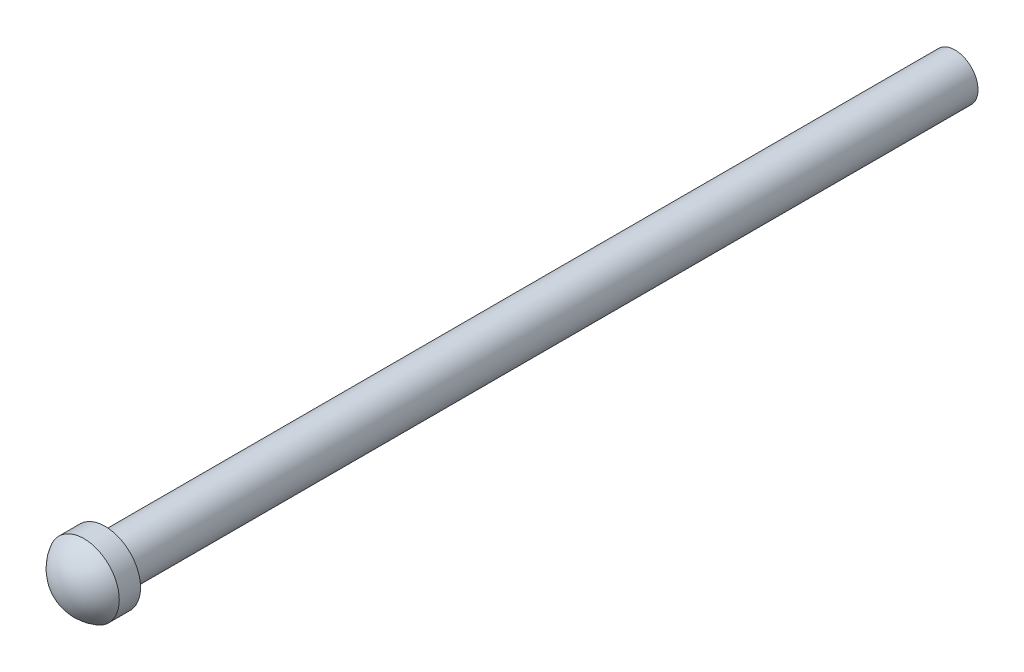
from build123d import *

# Parameters (mm, degrees)
CROQUIS1_R              = 3.25
CROQUIS3_R              = 5
SALIENTE_EXTRUIR1_DEPTH = 3
C_PULA1_FACE_RADIUS     = 5
C_PULA1_HEIGHT          = 3


with BuildPart() as part:
    # Barrer1: sweep along a path in Croquis2
    with BuildLine(Plane(origin=(0, 0, 0), x_dir=(0, 0, -1), z_dir=(1, 0, 0))) as barrer1_path:
        Line((0, 0), (120, 0))
    # Croquis1 → Barrer1 (sweep)
    with BuildSketch(Plane.XY):
        with Locations((5, 60)):
            Circle(CROQUIS1_R)
    sweep(path=barrer1_path.line)

    # Croquis3 → Saliente-Extruir1 (add)
    with BuildSketch(Plane.XY):
        with Locations((5, 60)):
            Circle(CROQUIS3_R)
    extrude(amount=SALIENTE_EXTRUIR1_DEPTH)

    # C_pula1: a dome of height H over a round flat face of radius A is a cap of a sphere of radius (A * A + H * H) / (2 * H)
    c_pula1_r = (C_PULA1_FACE_RADIUS * C_PULA1_FACE_RADIUS + C_PULA1_HEIGHT * C_PULA1_HEIGHT) / (2 * C_PULA1_HEIGHT)
    c_pula1_base = Plane((5, 60, 3), z_dir=(0, 0, 1))
    with Locations(c_pula1_base.offset(C_PULA1_HEIGHT - c_pula1_r)):
        c_pula1_ball = Sphere(c_pula1_r, mode=Mode.PRIVATE)
    add(split(c_pula1_ball, bisect_by=c_pula1_base, keep=Keep.TOP, mode=Mode.PRIVATE))


solid = part.part
